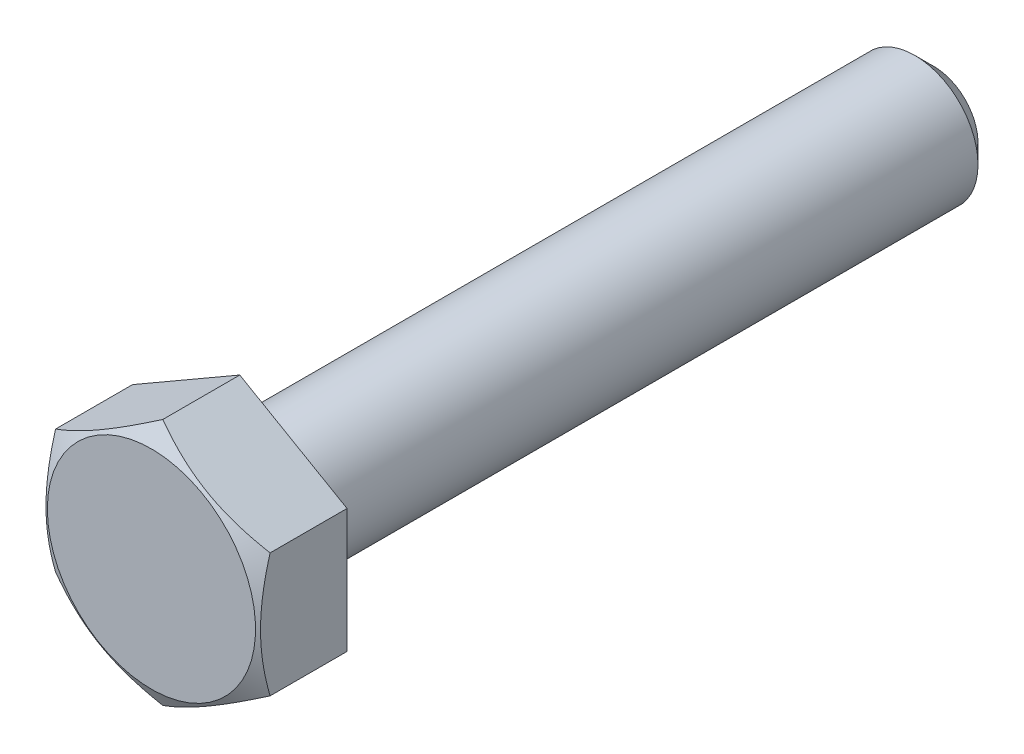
ISO-10303-21;
HEADER;
FILE_DESCRIPTION(('STEP AP214'),'2;1');
FILE_NAME('part.step','',(''),(''),'','','');
FILE_SCHEMA(('AUTOMOTIVE_DESIGN { 1 0 10303 214 1 1 1 1 }'));
ENDSEC;
DATA;
#1=APPLICATION_CONTEXT('core data for automotive mechanical design processes');
#2=APPLICATION_PROTOCOL_DEFINITION('international standard','automotive_design',2000,#1);
#3=PRODUCT_CONTEXT('',#1,'mechanical');
#4=PRODUCT('Part','Part','',(#3));
#5=PRODUCT_RELATED_PRODUCT_CATEGORY('part','',(#4));
#6=PRODUCT_DEFINITION_FORMATION('','',#4);
#7=PRODUCT_DEFINITION_CONTEXT('part definition',#1,'design');
#8=PRODUCT_DEFINITION('design','',#6,#7);
#9=PRODUCT_DEFINITION_SHAPE('','',#8);
#10=(LENGTH_UNIT() NAMED_UNIT(*) SI_UNIT(.MILLI.,.METRE.));
#11=(NAMED_UNIT(*) PLANE_ANGLE_UNIT() SI_UNIT($,.RADIAN.));
#12=(NAMED_UNIT(*) SI_UNIT($,.STERADIAN.) SOLID_ANGLE_UNIT());
#13=UNCERTAINTY_MEASURE_WITH_UNIT(LENGTH_MEASURE(1.E-05),#10,'distance_accuracy_value','');
#14=(GEOMETRIC_REPRESENTATION_CONTEXT(3) GLOBAL_UNCERTAINTY_ASSIGNED_CONTEXT((#13)) GLOBAL_UNIT_ASSIGNED_CONTEXT((#10,
#11,#12)) REPRESENTATION_CONTEXT('',''));
#15=CARTESIAN_POINT('',(0.,0.,0.));
#16=DIRECTION('',(0.,0.,1.));
#17=DIRECTION('',(1.,0.,0.));
#18=AXIS2_PLACEMENT_3D('',#15,#16,#17);
#19=CARTESIAN_POINT('',(0.,9.81495457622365,0.));
#20=DIRECTION('',(0.,0.,1.));
#21=DIRECTION('',(1.,0.,0.));
#22=AXIS2_PLACEMENT_3D('',#19,#20,#21);
#23=PLANE('',#22);
#24=DIRECTION('',(-0.866025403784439,0.5,0.));
#25=VECTOR('',#24,1.);
#26=CARTESIAN_POINT('',(8.5,4.90747728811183,0.));
#27=LINE('',#26,#25);
#28=CARTESIAN_POINT('',(8.5,4.90747728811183,0.));
#29=VERTEX_POINT('',#28);
#30=CARTESIAN_POINT('',(0.,9.81495457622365,0.));
#31=VERTEX_POINT('',#30);
#32=EDGE_CURVE('E77',#29,#31,#27,.T.);
#33=ORIENTED_EDGE('',*,*,#32,.F.);
#34=DIRECTION('',(0.,1.,0.));
#35=VECTOR('',#34,1.);
#36=CARTESIAN_POINT('',(8.5,-4.90747728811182,0.));
#37=LINE('',#36,#35);
#38=CARTESIAN_POINT('',(8.5,-4.90747728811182,0.));
#39=VERTEX_POINT('',#38);
#40=EDGE_CURVE('E82',#39,#29,#37,.T.);
#41=ORIENTED_EDGE('',*,*,#40,.F.);
#42=DIRECTION('',(0.866025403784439,0.5,0.));
#43=VECTOR('',#42,1.);
#44=CARTESIAN_POINT('',(0.,-9.81495457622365,0.));
#45=LINE('',#44,#43);
#46=CARTESIAN_POINT('',(0.,-9.81495457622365,0.));
#47=VERTEX_POINT('',#46);
#48=EDGE_CURVE('E88',#47,#39,#45,.T.);
#49=ORIENTED_EDGE('',*,*,#48,.F.);
#50=DIRECTION('',(0.866025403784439,-0.5,0.));
#51=VECTOR('',#50,1.);
#52=CARTESIAN_POINT('',(-8.5,-4.90747728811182,0.));
#53=LINE('',#52,#51);
#54=CARTESIAN_POINT('',(-8.5,-4.90747728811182,0.));
#55=VERTEX_POINT('',#54);
#56=EDGE_CURVE('E199',#55,#47,#53,.T.);
#57=ORIENTED_EDGE('',*,*,#56,.F.);
#58=DIRECTION('',(0.,-1.,0.));
#59=VECTOR('',#58,1.);
#60=CARTESIAN_POINT('',(-8.5,4.90747728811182,0.));
#61=LINE('',#60,#59);
#62=CARTESIAN_POINT('',(-8.5,4.90747728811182,0.));
#63=VERTEX_POINT('',#62);
#64=EDGE_CURVE('E209',#63,#55,#61,.T.);
#65=ORIENTED_EDGE('',*,*,#64,.F.);
#66=DIRECTION('',(-0.866025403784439,-0.5,0.));
#67=VECTOR('',#66,1.);
#68=CARTESIAN_POINT('',(0.,9.81495457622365,0.));
#69=LINE('',#68,#67);
#70=EDGE_CURVE('E207',#31,#63,#69,.T.);
#71=ORIENTED_EDGE('',*,*,#70,.F.);
#72=EDGE_LOOP('',(#33,#41,#49,#57,#65,#71));
#73=FACE_BOUND('',#72,.T.);
#74=CARTESIAN_POINT('',(0.,0.,0.));
#75=DIRECTION('',(0.,0.,1.));
#76=DIRECTION('',(1.,0.,0.));
#77=AXIS2_PLACEMENT_3D('',#74,#75,#76);
#78=CIRCLE('',#77,5.);
#79=CARTESIAN_POINT('',(5.,0.,0.));
#80=VERTEX_POINT('',#79);
#81=EDGE_CURVE('E98',#80,#80,#78,.F.);
#82=ORIENTED_EDGE('',*,*,#81,.F.);
#83=EDGE_LOOP('',(#82));
#84=FACE_BOUND('',#83,.T.);
#85=ADVANCED_FACE('F14',(#73,#84),#23,.F.);
#86=CARTESIAN_POINT('',(8.5,4.90747728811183,7.));
#87=DIRECTION('',(-0.5,-0.866025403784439,0.));
#88=DIRECTION('',(0.866025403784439,-0.5,0.));
#89=AXIS2_PLACEMENT_3D('',#86,#87,#88);
#90=PLANE('',#89);
#91=DIRECTION('',(0.,0.,-1.));
#92=VECTOR('',#91,1.);
#93=CARTESIAN_POINT('',(0.,9.81495457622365,7.));
#94=LINE('',#93,#92);
#95=CARTESIAN_POINT('',(0.,9.81495457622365,6.09647305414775));
#96=VERTEX_POINT('',#95);
#97=EDGE_CURVE('E76',#96,#31,#94,.T.);
#98=ORIENTED_EDGE('',*,*,#97,.F.);
#99=CARTESIAN_POINT('',(-0.00019999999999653,9.81507004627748,6.09640638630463));
#100=CARTESIAN_POINT('',(0.186639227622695,9.70719836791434,6.15867629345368));
#101=CARTESIAN_POINT('',(0.374175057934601,9.59892450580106,6.21812013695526));
#102=CARTESIAN_POINT('',(0.750769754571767,9.38149745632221,6.33057732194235));
#103=CARTESIAN_POINT('',(0.939829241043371,9.27234391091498,6.38358788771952));
#104=CARTESIAN_POINT('',(1.5100347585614,8.94313560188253,6.53192904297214));
#105=CARTESIAN_POINT('',(1.89343164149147,8.72178130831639,6.61630350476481));
#106=CARTESIAN_POINT('',(2.46717766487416,8.39052888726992,6.71524241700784));
#107=CARTESIAN_POINT('',(2.65581276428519,8.28162036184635,6.7434272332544));
#108=CARTESIAN_POINT('',(3.03393602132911,8.06331079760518,6.79068834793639));
#109=CARTESIAN_POINT('',(3.22342410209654,7.95390980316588,6.80976545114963));
#110=CARTESIAN_POINT('',(3.6027265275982,7.73491944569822,6.83832766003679));
#111=CARTESIAN_POINT('',(3.79254025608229,7.62533043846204,6.84782365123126));
#112=CARTESIAN_POINT('',(4.17234305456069,7.40605119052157,6.85702005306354));
#113=CARTESIAN_POINT('',(4.36233211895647,7.29636095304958,6.85672076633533));
#114=CARTESIAN_POINT('',(4.71752301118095,7.09129139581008,6.84700795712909));
#115=CARTESIAN_POINT('',(4.8827499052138,6.99589760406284,6.83877926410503));
#116=CARTESIAN_POINT('',(5.21281671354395,6.80533344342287,6.81507319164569));
#117=CARTESIAN_POINT('',(5.37765660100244,6.71016309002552,6.79959532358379));
#118=CARTESIAN_POINT('',(5.87153810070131,6.4250204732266,6.74265381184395));
#119=CARTESIAN_POINT('',(6.19970550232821,6.23555293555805,6.69068937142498));
#120=CARTESIAN_POINT('',(6.85952142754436,5.85460803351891,6.56077749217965));
#121=CARTESIAN_POINT('',(7.19108574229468,5.66317928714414,6.48227936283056));
#122=CARTESIAN_POINT('',(7.84926989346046,5.28317649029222,6.30412109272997));
#123=CARTESIAN_POINT('',(8.17589815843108,5.0945975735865,6.20450279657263));
#124=CARTESIAN_POINT('',(8.5002,4.90736181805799,6.09640638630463));
#125=B_SPLINE_CURVE_WITH_KNOTS('',3,(#99,#100,#101,#102,#103,#104,#105,#106,#107,#108,#109,#110,
#111,#112,#113,#114,#115,#116,#117,#118,#119,#120,#121,#122,#123,#124),.UNSPECIFIED.,.F.,.F.,(4,
2,2,2,2,2,2,2,2,2,2,2,4),(0.,0.673596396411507,1.34748239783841,2.69805431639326,
3.35679995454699,4.01548737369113,4.67342558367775,5.33134346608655,5.90409556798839,
6.47688628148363,7.62328361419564,8.79510569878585,9.96462743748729),.UNSPECIFIED.);
#126=CARTESIAN_POINT('',(8.5,4.90747728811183,6.09647305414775));
#127=VERTEX_POINT('',#126);
#128=EDGE_CURVE('E68',#96,#127,#125,.T.);
#129=ORIENTED_EDGE('',*,*,#128,.T.);
#130=DIRECTION('',(0.,0.,-1.));
#131=VECTOR('',#130,1.);
#132=CARTESIAN_POINT('',(8.5,4.90747728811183,7.));
#133=LINE('',#132,#131);
#134=EDGE_CURVE('E37',#127,#29,#133,.T.);
#135=ORIENTED_EDGE('',*,*,#134,.T.);
#136=ORIENTED_EDGE('',*,*,#32,.T.);
#137=EDGE_LOOP('',(#98,#129,#135,#136));
#138=FACE_BOUND('',#137,.T.);
#139=ADVANCED_FACE('F75',(#138),#90,.F.);
#140=CARTESIAN_POINT('',(0.,9.81495457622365,7.));
#141=DIRECTION('',(0.5,-0.866025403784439,0.));
#142=DIRECTION('',(0.866025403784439,0.5,0.));
#143=AXIS2_PLACEMENT_3D('',#140,#141,#142);
#144=PLANE('',#143);
#145=DIRECTION('',(0.,0.,-1.));
#146=VECTOR('',#145,1.);
#147=CARTESIAN_POINT('',(-8.5,4.90747728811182,7.));
#148=LINE('',#147,#146);
#149=CARTESIAN_POINT('',(-8.5,4.90747728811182,6.09647305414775));
#150=VERTEX_POINT('',#149);
#151=EDGE_CURVE('E95',#150,#63,#148,.T.);
#152=ORIENTED_EDGE('',*,*,#151,.F.);
#153=CARTESIAN_POINT('',(-8.5002,4.90736181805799,6.09640638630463));
#154=CARTESIAN_POINT('',(-8.31336077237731,5.01523349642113,6.15867629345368));
#155=CARTESIAN_POINT('',(-8.1258249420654,5.12350735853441,6.21812013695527));
#156=CARTESIAN_POINT('',(-7.74923024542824,5.34093440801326,6.33057732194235));
#157=CARTESIAN_POINT('',(-7.56017075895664,5.4500879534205,6.38358788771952));
#158=CARTESIAN_POINT('',(-6.98996524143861,5.77929626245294,6.53192904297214));
#159=CARTESIAN_POINT('',(-6.60656835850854,6.00065055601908,6.61630350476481));
#160=CARTESIAN_POINT('',(-6.03282233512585,6.33190297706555,6.71524241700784));
#161=CARTESIAN_POINT('',(-5.84418723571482,6.44081150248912,6.7434272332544));
#162=CARTESIAN_POINT('',(-5.4660639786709,6.65912106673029,6.79068834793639));
#163=CARTESIAN_POINT('',(-5.27657589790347,6.76852206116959,6.80976545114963));
#164=CARTESIAN_POINT('',(-4.89727347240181,6.98751241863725,6.83832766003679));
#165=CARTESIAN_POINT('',(-4.70745974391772,7.09710142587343,6.84782365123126));
#166=CARTESIAN_POINT('',(-4.32765694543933,7.3163806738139,6.85702005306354));
#167=CARTESIAN_POINT('',(-4.13766788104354,7.42607091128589,6.85672076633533));
#168=CARTESIAN_POINT('',(-3.78247698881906,7.63114046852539,6.84700795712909));
#169=CARTESIAN_POINT('',(-3.61725009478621,7.72653426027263,6.83877926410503));
#170=CARTESIAN_POINT('',(-3.28718328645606,7.9170984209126,6.81507319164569));
#171=CARTESIAN_POINT('',(-3.12234339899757,8.01226877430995,6.79959532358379));
#172=CARTESIAN_POINT('',(-2.6284618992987,8.29741139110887,6.74265381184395));
#173=CARTESIAN_POINT('',(-2.3002944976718,8.48687892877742,6.69068937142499));
#174=CARTESIAN_POINT('',(-1.64047857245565,8.86782383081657,6.56077749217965));
#175=CARTESIAN_POINT('',(-1.30891425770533,9.05925257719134,6.48227936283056));
#176=CARTESIAN_POINT('',(-0.650730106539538,9.43925537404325,6.30412109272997));
#177=CARTESIAN_POINT('',(-0.32410184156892,9.62783429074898,6.20450279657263));
#178=CARTESIAN_POINT('',(0.000200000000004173,9.81507004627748,6.09640638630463));
#179=B_SPLINE_CURVE_WITH_KNOTS('',3,(#153,#154,#155,#156,#157,#158,#159,#160,#161,#162,#163,
#164,#165,#166,#167,#168,#169,#170,#171,#172,#173,#174,#175,#176,#177,#178),.UNSPECIFIED.,.F.,
.F.,(4,2,2,2,2,2,2,2,2,2,2,2,4),(0.,0.673596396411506,1.34748239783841,2.69805431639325,
3.35679995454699,4.01548737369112,4.67342558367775,5.33134346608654,5.90409556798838,
6.47688628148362,7.62328361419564,8.79510569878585,9.9646274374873),.UNSPECIFIED.);
#180=EDGE_CURVE('E78',#150,#96,#179,.T.);
#181=ORIENTED_EDGE('',*,*,#180,.T.);
#182=ORIENTED_EDGE('',*,*,#97,.T.);
#183=ORIENTED_EDGE('',*,*,#70,.T.);
#184=EDGE_LOOP('',(#152,#181,#182,#183));
#185=FACE_BOUND('',#184,.T.);
#186=ADVANCED_FACE('F122',(#185),#144,.F.);
#187=CARTESIAN_POINT('',(-8.5,4.90747728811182,7.));
#188=DIRECTION('',(1.,0.,0.));
#189=DIRECTION('',(0.,1.,0.));
#190=AXIS2_PLACEMENT_3D('',#187,#188,#189);
#191=PLANE('',#190);
#192=DIRECTION('',(0.,0.,-1.));
#193=VECTOR('',#192,1.);
#194=CARTESIAN_POINT('',(-8.5,-4.90747728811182,7.));
#195=LINE('',#194,#193);
#196=CARTESIAN_POINT('',(-8.5,-4.90747728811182,6.09647305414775));
#197=VERTEX_POINT('',#196);
#198=EDGE_CURVE('E93',#197,#55,#195,.T.);
#199=ORIENTED_EDGE('',*,*,#198,.F.);
#200=CARTESIAN_POINT('',(-8.5,-13.1026642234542,2.74593746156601));
#201=CARTESIAN_POINT('',(-8.5,-12.7320710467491,2.92538754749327));
#202=CARTESIAN_POINT('',(-8.50000000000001,-12.3606185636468,3.1030938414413));
#203=CARTESIAN_POINT('',(-8.50000000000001,-11.6155376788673,3.45403645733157));
#204=CARTESIAN_POINT('',(-8.50000000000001,-11.2419089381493,3.62727205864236));
#205=CARTESIAN_POINT('',(-8.50000000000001,-10.4900547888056,3.96917951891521));
#206=CARTESIAN_POINT('',(-8.50000000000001,-10.1118153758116,4.13782069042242));
#207=CARTESIAN_POINT('',(-8.50000000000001,-9.35230025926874,4.46809461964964));
#208=CARTESIAN_POINT('',(-8.50000000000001,-8.97102470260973,4.62972771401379));
#209=CARTESIAN_POINT('',(-8.50000000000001,-8.19283605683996,4.94905443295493));
#210=CARTESIAN_POINT('',(-8.50000000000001,-7.79580686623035,5.10646670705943));
#211=CARTESIAN_POINT('',(-8.50000000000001,-6.99707523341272,5.4091842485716));
#212=CARTESIAN_POINT('',(-8.5,-6.59537226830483,5.55448814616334));
#213=CARTESIAN_POINT('',(-8.5,-5.7874270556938,5.82911560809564));
#214=CARTESIAN_POINT('',(-8.50000000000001,-5.38119616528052,5.95847222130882));
#215=CARTESIAN_POINT('',(-8.5,-4.5629229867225,6.1970038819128));
#216=CARTESIAN_POINT('',(-8.5,-4.15088259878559,6.30618537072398));
#217=CARTESIAN_POINT('',(-8.5,-3.32295792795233,6.49849151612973));
#218=CARTESIAN_POINT('',(-8.5,-2.90710664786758,6.58175438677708));
#219=CARTESIAN_POINT('',(-8.5,-2.27960724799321,6.68356538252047));
#220=CARTESIAN_POINT('',(-8.5,-2.06980434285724,6.71365656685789));
#221=CARTESIAN_POINT('',(-8.5,-1.64918293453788,6.76555254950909));
#222=CARTESIAN_POINT('',(-8.5,-1.43836453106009,6.78735814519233));
#223=CARTESIAN_POINT('',(-8.5,-1.01871348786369,6.82197913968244));
#224=CARTESIAN_POINT('',(-8.5,-0.809890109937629,6.83490638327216));
#225=CARTESIAN_POINT('',(-8.5,-0.39188410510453,6.85192420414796));
#226=CARTESIAN_POINT('',(-8.5,-0.182701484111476,6.85601492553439));
#227=CARTESIAN_POINT('',(-8.5,0.235650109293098,6.85526233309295));
#228=CARTESIAN_POINT('',(-8.5,0.444819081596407,6.85041895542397));
#229=CARTESIAN_POINT('',(-8.5,0.86276947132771,6.83191500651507));
#230=CARTESIAN_POINT('',(-8.5,1.07155086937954,6.81825400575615));
#231=CARTESIAN_POINT('',(-8.5,1.57574896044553,6.77490263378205));
#232=CARTESIAN_POINT('',(-8.5,1.87080068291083,6.74089371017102));
#233=CARTESIAN_POINT('',(-8.5,2.45866338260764,6.65713713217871));
#234=CARTESIAN_POINT('',(-8.5,2.75147403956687,6.60738726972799));
#235=CARTESIAN_POINT('',(-8.5,3.33459303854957,6.49391875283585));
#236=CARTESIAN_POINT('',(-8.5,3.62489919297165,6.43018896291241));
#237=CARTESIAN_POINT('',(-8.5,4.20257464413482,6.29070067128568));
#238=CARTESIAN_POINT('',(-8.5,4.48994399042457,6.21494237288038));
#239=CARTESIAN_POINT('',(-8.5,5.0680151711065,6.05145913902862));
#240=CARTESIAN_POINT('',(-8.5,5.35865292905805,5.96350918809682));
#241=CARTESIAN_POINT('',(-8.5,5.93706457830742,5.77869577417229));
#242=CARTESIAN_POINT('',(-8.5,6.22483845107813,5.68183225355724));
#243=CARTESIAN_POINT('',(-8.5,6.79766756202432,5.48071443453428));
#244=CARTESIAN_POINT('',(-8.5,7.08272370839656,5.3764627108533));
#245=CARTESIAN_POINT('',(-8.5,7.65048563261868,5.1617779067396));
#246=CARTESIAN_POINT('',(-8.5,7.93319143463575,5.05134488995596));
#247=CARTESIAN_POINT('',(-8.5,8.58625691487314,4.78932204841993));
#248=CARTESIAN_POINT('',(-8.5,8.95585125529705,4.63582786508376));
#249=CARTESIAN_POINT('',(-8.5,9.69201525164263,4.32173022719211));
#250=CARTESIAN_POINT('',(-8.5,10.0585847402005,4.16112638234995));
#251=CARTESIAN_POINT('',(-8.5,10.7892442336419,3.83419501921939));
#252=CARTESIAN_POINT('',(-8.5,11.1533337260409,3.66786635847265));
#253=CARTESIAN_POINT('',(-8.5,11.879361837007,3.33060757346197));
#254=CARTESIAN_POINT('',(-8.5,12.2413004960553,3.15967753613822));
#255=CARTESIAN_POINT('',(-8.5,12.9637389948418,2.81388116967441));
#256=CARTESIAN_POINT('',(-8.5,13.3242370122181,2.63901103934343));
#257=CARTESIAN_POINT('',(-8.5,14.0437060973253,2.28615454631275));
#258=CARTESIAN_POINT('',(-8.5,14.4026771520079,2.10816815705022));
#259=CARTESIAN_POINT('',(-8.5,15.4775690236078,1.57038636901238));
#260=CARTESIAN_POINT('',(-8.5,16.1915560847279,1.20672611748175));
#261=CARTESIAN_POINT('',(-8.5,17.5583767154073,0.501692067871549));
#262=CARTESIAN_POINT('',(-8.49999999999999,18.2115029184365,0.160883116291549));
#263=CARTESIAN_POINT('',(-8.49999999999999,19.515315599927,-0.525416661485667));
#264=CARTESIAN_POINT('',(-8.49999999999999,20.1660019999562,-0.870907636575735));
#265=CARTESIAN_POINT('',(-8.49999999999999,21.4639477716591,-1.56466133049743));
#266=CARTESIAN_POINT('',(-8.49999999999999,22.1112115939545,-1.91291573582));
#267=CARTESIAN_POINT('',(-8.49999999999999,23.4041708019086,-2.6122458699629));
#268=CARTESIAN_POINT('',(-8.49999999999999,24.0498662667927,-2.96332145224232));
#269=CARTESIAN_POINT('',(-8.5,24.69498034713,-3.3154549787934));
#270=B_SPLINE_CURVE_WITH_KNOTS('',3,(#200,#201,#202,#203,#204,#205,#206,#207,#208,#209,#210,
#211,#212,#213,#214,#215,#216,#217,#218,#219,#220,#221,#222,#223,#224,#225,#226,#227,#228,#229,
#230,#231,#232,#233,#234,#235,#236,#237,#238,#239,#240,#241,#242,#243,#244,#245,#246,#247,#248,
#249,#250,#251,#252,#253,#254,#255,#256,#257,#258,#259,#260,#261,#262,#263,#264,#265,#266,#267,
#268,#269),.UNSPECIFIED.,.F.,.F.,(4,2,2,2,2,2,2,2,2,2,2,2,2,2,2,2,2,2,2,2,2,2,2,2,2,2,2,2,2,2,2,
2,2,2,4),(0.,1.23527849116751,2.47075486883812,3.71309244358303,4.95537027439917,
6.23650441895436,7.51778330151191,8.79636058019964,10.0745289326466,11.3457596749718,
11.9814713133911,12.6171217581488,13.2446100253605,13.8720880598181,14.4995705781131,
15.1270836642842,16.017604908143,16.9082511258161,17.7996093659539,18.690952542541,
19.6017420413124,20.5125374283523,21.4230169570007,22.3334871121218,23.5339891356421,
24.7345571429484,25.9353661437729,27.1361524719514,28.3381515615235,29.5401609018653,
31.9438880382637,34.1539630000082,36.3641084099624,38.569114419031,40.774006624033),.UNSPECIFIED.);
#271=EDGE_CURVE('E160',#197,#150,#270,.T.);
#272=ORIENTED_EDGE('',*,*,#271,.T.);
#273=ORIENTED_EDGE('',*,*,#151,.T.);
#274=ORIENTED_EDGE('',*,*,#64,.T.);
#275=EDGE_LOOP('',(#199,#272,#273,#274));
#276=FACE_BOUND('',#275,.T.);
#277=ADVANCED_FACE('F179',(#276),#191,.F.);
#278=CARTESIAN_POINT('',(-8.5,-4.90747728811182,7.));
#279=DIRECTION('',(0.5,0.866025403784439,0.));
#280=DIRECTION('',(-0.866025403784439,0.5,0.));
#281=AXIS2_PLACEMENT_3D('',#278,#279,#280);
#282=PLANE('',#281);
#283=DIRECTION('',(0.,0.,-1.));
#284=VECTOR('',#283,1.);
#285=CARTESIAN_POINT('',(0.,-9.81495457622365,7.));
#286=LINE('',#285,#284);
#287=CARTESIAN_POINT('',(0.,-9.81495457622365,6.09647305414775));
#288=VERTEX_POINT('',#287);
#289=EDGE_CURVE('E86',#288,#47,#286,.T.);
#290=ORIENTED_EDGE('',*,*,#289,.F.);
#291=CARTESIAN_POINT('',(0.000199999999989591,-9.81507004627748,6.09640638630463));
#292=CARTESIAN_POINT('',(-0.186639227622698,-9.70719836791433,6.15867629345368));
#293=CARTESIAN_POINT('',(-0.374175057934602,-9.59892450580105,6.21812013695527));
#294=CARTESIAN_POINT('',(-0.750769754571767,-9.3814974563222,6.33057732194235));
#295=CARTESIAN_POINT('',(-0.939829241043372,-9.27234391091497,6.38358788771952));
#296=CARTESIAN_POINT('',(-1.5100347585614,-8.94313560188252,6.53192904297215));
#297=CARTESIAN_POINT('',(-1.89343164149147,-8.72178130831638,6.61630350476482));
#298=CARTESIAN_POINT('',(-2.46717766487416,-8.39052888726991,6.71524241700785));
#299=CARTESIAN_POINT('',(-2.65581276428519,-8.28162036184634,6.7434272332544));
#300=CARTESIAN_POINT('',(-3.03393602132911,-8.06331079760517,6.7906883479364));
#301=CARTESIAN_POINT('',(-3.22342410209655,-7.95390980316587,6.80976545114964));
#302=CARTESIAN_POINT('',(-3.6027265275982,-7.73491944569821,6.8383276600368));
#303=CARTESIAN_POINT('',(-3.79254025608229,-7.62533043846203,6.84782365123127));
#304=CARTESIAN_POINT('',(-4.17234305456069,-7.40605119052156,6.85702005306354));
#305=CARTESIAN_POINT('',(-4.36233211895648,-7.29636095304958,6.85672076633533));
#306=CARTESIAN_POINT('',(-4.71752301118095,-7.09129139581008,6.84700795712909));
#307=CARTESIAN_POINT('',(-4.8827499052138,-6.99589760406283,6.83877926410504));
#308=CARTESIAN_POINT('',(-5.21281671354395,-6.80533344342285,6.81507319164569));
#309=CARTESIAN_POINT('',(-5.37765660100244,-6.71016309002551,6.79959532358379));
#310=CARTESIAN_POINT('',(-5.87153810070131,-6.42502047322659,6.74265381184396));
#311=CARTESIAN_POINT('',(-6.19970550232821,-6.23555293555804,6.69068937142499));
#312=CARTESIAN_POINT('',(-6.85952142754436,-5.8546080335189,6.56077749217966));
#313=CARTESIAN_POINT('',(-7.19108574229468,-5.66317928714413,6.48227936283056));
#314=CARTESIAN_POINT('',(-7.84926989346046,-5.28317649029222,6.30412109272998));
#315=CARTESIAN_POINT('',(-8.17589815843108,-5.09459757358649,6.20450279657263));
#316=CARTESIAN_POINT('',(-8.5002,-4.90736181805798,6.09640638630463));
#317=B_SPLINE_CURVE_WITH_KNOTS('',3,(#291,#292,#293,#294,#295,#296,#297,#298,#299,#300,#301,
#302,#303,#304,#305,#306,#307,#308,#309,#310,#311,#312,#313,#314,#315,#316),.UNSPECIFIED.,.F.,
.F.,(4,2,2,2,2,2,2,2,2,2,2,2,4),(0.,0.673596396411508,1.34748239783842,2.69805431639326,
3.35679995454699,4.01548737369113,4.67342558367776,5.33134346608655,5.90409556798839,
6.47688628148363,7.62328361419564,8.79510569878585,9.96462743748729),.UNSPECIFIED.);
#318=EDGE_CURVE('E154',#288,#197,#317,.T.);
#319=ORIENTED_EDGE('',*,*,#318,.T.);
#320=ORIENTED_EDGE('',*,*,#198,.T.);
#321=ORIENTED_EDGE('',*,*,#56,.T.);
#322=EDGE_LOOP('',(#290,#319,#320,#321));
#323=FACE_BOUND('',#322,.T.);
#324=ADVANCED_FACE('F184',(#323),#282,.F.);
#325=CARTESIAN_POINT('',(0.,-9.81495457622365,7.));
#326=DIRECTION('',(-0.5,0.866025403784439,0.));
#327=DIRECTION('',(-0.866025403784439,-0.5,0.));
#328=AXIS2_PLACEMENT_3D('',#325,#326,#327);
#329=PLANE('',#328);
#330=DIRECTION('',(0.,0.,-1.));
#331=VECTOR('',#330,1.);
#332=CARTESIAN_POINT('',(8.5,-4.90747728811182,7.));
#333=LINE('',#332,#331);
#334=CARTESIAN_POINT('',(8.5,-4.90747728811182,6.09647305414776));
#335=VERTEX_POINT('',#334);
#336=EDGE_CURVE('E84',#335,#39,#333,.T.);
#337=ORIENTED_EDGE('',*,*,#336,.F.);
#338=CARTESIAN_POINT('',(8.5002,-4.90736181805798,6.09640638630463));
#339=CARTESIAN_POINT('',(8.31336077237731,-5.01523349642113,6.15867629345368));
#340=CARTESIAN_POINT('',(8.12582494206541,-5.12350735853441,6.21812013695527));
#341=CARTESIAN_POINT('',(7.74923024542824,-5.34093440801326,6.33057732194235));
#342=CARTESIAN_POINT('',(7.56017075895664,-5.45008795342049,6.38358788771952));
#343=CARTESIAN_POINT('',(6.98996524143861,-5.77929626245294,6.53192904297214));
#344=CARTESIAN_POINT('',(6.60656835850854,-6.00065055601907,6.61630350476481));
#345=CARTESIAN_POINT('',(6.03282233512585,-6.33190297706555,6.71524241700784));
#346=CARTESIAN_POINT('',(5.84418723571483,-6.44081150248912,6.7434272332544));
#347=CARTESIAN_POINT('',(5.4660639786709,-6.65912106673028,6.7906883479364));
#348=CARTESIAN_POINT('',(5.27657589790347,-6.76852206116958,6.80976545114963));
#349=CARTESIAN_POINT('',(4.89727347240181,-6.98751241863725,6.83832766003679));
#350=CARTESIAN_POINT('',(4.70745974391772,-7.09710142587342,6.84782365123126));
#351=CARTESIAN_POINT('',(4.32765694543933,-7.31638067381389,6.85702005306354));
#352=CARTESIAN_POINT('',(4.13766788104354,-7.42607091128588,6.85672076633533));
#353=CARTESIAN_POINT('',(3.78247698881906,-7.63114046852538,6.84700795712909));
#354=CARTESIAN_POINT('',(3.61725009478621,-7.72653426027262,6.83877926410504));
#355=CARTESIAN_POINT('',(3.28718328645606,-7.9170984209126,6.81507319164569));
#356=CARTESIAN_POINT('',(3.12234339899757,-8.01226877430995,6.79959532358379));
#357=CARTESIAN_POINT('',(2.6284618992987,-8.29741139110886,6.74265381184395));
#358=CARTESIAN_POINT('',(2.30029449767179,-8.48687892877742,6.69068937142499));
#359=CARTESIAN_POINT('',(1.64047857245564,-8.86782383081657,6.56077749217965));
#360=CARTESIAN_POINT('',(1.30891425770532,-9.05925257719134,6.48227936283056));
#361=CARTESIAN_POINT('',(0.650730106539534,-9.43925537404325,6.30412109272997));
#362=CARTESIAN_POINT('',(0.324101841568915,-9.62783429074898,6.20450279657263));
#363=CARTESIAN_POINT('',(-0.000200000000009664,-9.81507004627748,6.09640638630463));
#364=B_SPLINE_CURVE_WITH_KNOTS('',3,(#338,#339,#340,#341,#342,#343,#344,#345,#346,#347,#348,
#349,#350,#351,#352,#353,#354,#355,#356,#357,#358,#359,#360,#361,#362,#363),.UNSPECIFIED.,.F.,
.F.,(4,2,2,2,2,2,2,2,2,2,2,2,4),(0.,0.673596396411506,1.34748239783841,2.69805431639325,
3.35679995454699,4.01548737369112,4.67342558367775,5.33134346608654,5.90409556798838,
6.47688628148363,7.62328361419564,8.79510569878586,9.96462743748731),.UNSPECIFIED.);
#365=EDGE_CURVE('E29',#335,#288,#364,.T.);
#366=ORIENTED_EDGE('',*,*,#365,.T.);
#367=ORIENTED_EDGE('',*,*,#289,.T.);
#368=ORIENTED_EDGE('',*,*,#48,.T.);
#369=EDGE_LOOP('',(#337,#366,#367,#368));
#370=FACE_BOUND('',#369,.T.);
#371=ADVANCED_FACE('F131',(#370),#329,.F.);
#372=CARTESIAN_POINT('',(8.5,-4.90747728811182,7.));
#373=DIRECTION('',(-1.,0.,0.));
#374=DIRECTION('',(0.,0.,1.));
#375=AXIS2_PLACEMENT_3D('',#372,#373,#374);
#376=PLANE('',#375);
#377=ORIENTED_EDGE('',*,*,#134,.F.);
#378=CARTESIAN_POINT('',(8.5,-13.1026642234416,2.74593746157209));
#379=CARTESIAN_POINT('',(8.5,-12.732071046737,2.9253875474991));
#380=CARTESIAN_POINT('',(8.5,-12.3606185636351,3.10309384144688));
#381=CARTESIAN_POINT('',(8.5,-11.6155376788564,3.45403645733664));
#382=CARTESIAN_POINT('',(8.5,-11.2419089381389,3.62727205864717));
#383=CARTESIAN_POINT('',(8.5,-10.490054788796,3.96917951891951));
#384=CARTESIAN_POINT('',(8.5,-10.1118153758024,4.13782069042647));
#385=CARTESIAN_POINT('',(8.5,-9.35230025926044,4.46809461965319));
#386=CARTESIAN_POINT('',(8.5,-8.97102470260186,4.62972771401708));
#387=CARTESIAN_POINT('',(8.5,-8.19283605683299,4.94905443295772));
#388=CARTESIAN_POINT('',(8.5,-7.79580686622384,5.10646670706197));
#389=CARTESIAN_POINT('',(8.5,-6.99707523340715,5.40918424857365));
#390=CARTESIAN_POINT('',(8.5,-6.59537226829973,5.55448814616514));
#391=CARTESIAN_POINT('',(8.5,-5.78742705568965,5.82911560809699));
#392=CARTESIAN_POINT('',(8.5,-5.38119616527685,5.95847222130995));
#393=CARTESIAN_POINT('',(8.5,-4.56292298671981,6.19700388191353));
#394=CARTESIAN_POINT('',(8.5,-4.1508825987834,6.30618537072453));
#395=CARTESIAN_POINT('',(8.5,-3.32295792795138,6.49849151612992));
#396=CARTESIAN_POINT('',(8.5,-2.90710664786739,6.5817543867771));
#397=CARTESIAN_POINT('',(8.5,-2.27960724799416,6.68356538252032));
#398=CARTESIAN_POINT('',(8.5,-2.06980434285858,6.7136565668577));
#399=CARTESIAN_POINT('',(8.5,-1.64918293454,6.76555254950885));
#400=CARTESIAN_POINT('',(8.5,-1.43836453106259,6.78735814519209));
#401=CARTESIAN_POINT('',(8.5,-1.01871348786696,6.82197913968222));
#402=CARTESIAN_POINT('',(8.5,-0.809890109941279,6.83490638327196));
#403=CARTESIAN_POINT('',(8.5,-0.391884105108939,6.85192420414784));
#404=CARTESIAN_POINT('',(8.5,-0.182701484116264,6.85601492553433));
#405=CARTESIAN_POINT('',(8.5,0.235650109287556,6.85526233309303));
#406=CARTESIAN_POINT('',(8.5,0.444819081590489,6.85041895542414));
#407=CARTESIAN_POINT('',(8.5,0.862769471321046,6.83191500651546));
#408=CARTESIAN_POINT('',(8.5,1.0715508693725,6.81825400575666));
#409=CARTESIAN_POINT('',(8.5,1.57574896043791,6.77490263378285));
#410=CARTESIAN_POINT('',(8.5,1.870800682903,6.74089371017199));
#411=CARTESIAN_POINT('',(8.5,2.45866338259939,6.65713713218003));
#412=CARTESIAN_POINT('',(8.5,2.75147403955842,6.60738726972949));
#413=CARTESIAN_POINT('',(8.5,3.33459303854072,6.49391875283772));
#414=CARTESIAN_POINT('',(8.5,3.6248991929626,6.43018896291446));
#415=CARTESIAN_POINT('',(8.5,4.20257464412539,6.2907006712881));
#416=CARTESIAN_POINT('',(8.5,4.48994399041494,6.21494237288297));
#417=CARTESIAN_POINT('',(8.5,5.06801517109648,6.05145913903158));
#418=CARTESIAN_POINT('',(8.5,5.35865292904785,5.96350918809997));
#419=CARTESIAN_POINT('',(8.5,5.93706457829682,5.7786957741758));
#420=CARTESIAN_POINT('',(8.5,6.22483845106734,5.68183225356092));
#421=CARTESIAN_POINT('',(8.5,6.79766756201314,5.48071443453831));
#422=CARTESIAN_POINT('',(8.5,7.08272370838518,5.3764627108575));
#423=CARTESIAN_POINT('',(8.5,7.65048563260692,5.16177790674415));
#424=CARTESIAN_POINT('',(8.5,7.93319143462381,5.05134488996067));
#425=CARTESIAN_POINT('',(8.5,8.58625691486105,4.7893220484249));
#426=CARTESIAN_POINT('',(8.5,8.95585125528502,4.63582786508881));
#427=CARTESIAN_POINT('',(8.5,9.6920152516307,4.3217302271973));
#428=CARTESIAN_POINT('',(8.5,10.0585847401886,4.16112638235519));
#429=CARTESIAN_POINT('',(8.5,10.7892442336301,3.83419501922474));
#430=CARTESIAN_POINT('',(8.5,11.1533337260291,3.66786635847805));
#431=CARTESIAN_POINT('',(8.5,11.8793618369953,3.33060757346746));
#432=CARTESIAN_POINT('',(8.5,12.2413004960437,3.15967753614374));
#433=CARTESIAN_POINT('',(8.5,12.9637389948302,2.81388116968));
#434=CARTESIAN_POINT('',(8.5,13.3242370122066,2.63901103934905));
#435=CARTESIAN_POINT('',(8.5,14.0437060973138,2.28615454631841));
#436=CARTESIAN_POINT('',(8.5,14.4026771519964,2.1081681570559));
#437=CARTESIAN_POINT('',(8.5,15.4775690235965,1.57038636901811));
#438=CARTESIAN_POINT('',(8.5,16.1915560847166,1.20672611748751));
#439=CARTESIAN_POINT('',(8.5,17.5583767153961,0.501692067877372));
#440=CARTESIAN_POINT('',(8.5,18.2115029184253,0.160883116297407));
#441=CARTESIAN_POINT('',(8.5,19.5153155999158,-0.525416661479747));
#442=CARTESIAN_POINT('',(8.5,20.166001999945,-0.870907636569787));
#443=CARTESIAN_POINT('',(8.5,21.4639477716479,-1.56466133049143));
#444=CARTESIAN_POINT('',(8.5,22.1112115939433,-1.91291573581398));
#445=CARTESIAN_POINT('',(8.5,23.4041708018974,-2.61224586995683));
#446=CARTESIAN_POINT('',(8.5,24.0498662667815,-2.96332145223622));
#447=CARTESIAN_POINT('',(8.5,24.6949803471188,-3.31545497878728));
#448=B_SPLINE_CURVE_WITH_KNOTS('',3,(#378,#379,#380,#381,#382,#383,#384,#385,#386,#387,#388,
#389,#390,#391,#392,#393,#394,#395,#396,#397,#398,#399,#400,#401,#402,#403,#404,#405,#406,#407,
#408,#409,#410,#411,#412,#413,#414,#415,#416,#417,#418,#419,#420,#421,#422,#423,#424,#425,#426,
#427,#428,#429,#430,#431,#432,#433,#434,#435,#436,#437,#438,#439,#440,#441,#442,#443,#444,#445,
#446,#447),.UNSPECIFIED.,.F.,.F.,(4,2,2,2,2,2,2,2,2,2,2,2,2,2,2,2,2,2,2,2,2,2,2,2,2,2,2,2,2,2,2,
2,2,2,4),(0.,1.23527849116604,2.47075486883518,3.7130924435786,4.95537027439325,
6.23650441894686,7.51778330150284,8.796360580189,10.0745289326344,11.3457596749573,
11.9814713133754,12.617121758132,13.2446100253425,13.872088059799,14.4995705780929,
15.1270836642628,16.0176049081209,16.9082511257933,17.7996093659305,18.6909525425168,
19.6017420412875,20.5125374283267,21.4230169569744,22.3334871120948,23.5339891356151,
24.7345571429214,25.9353661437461,27.1361524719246,28.3381515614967,29.5401609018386,
31.9438880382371,34.1539629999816,36.3641084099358,38.5691144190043,40.7740066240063),.UNSPECIFIED.);
#449=EDGE_CURVE('E66',#127,#335,#448,.F.);
#450=ORIENTED_EDGE('',*,*,#449,.T.);
#451=ORIENTED_EDGE('',*,*,#336,.T.);
#452=ORIENTED_EDGE('',*,*,#40,.T.);
#453=EDGE_LOOP('',(#377,#450,#451,#452));
#454=FACE_BOUND('',#453,.T.);
#455=ADVANCED_FACE('F80',(#454),#376,.F.);
#456=CARTESIAN_POINT('',(0.,0.,7.));
#457=DIRECTION('',(0.,0.,-1.));
#458=DIRECTION('',(-1.,0.,0.));
#459=AXIS2_PLACEMENT_3D('',#456,#457,#458);
#460=CONICAL_SURFACE('',#459,8.25,1.0471975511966);
#461=CARTESIAN_POINT('',(0.,0.,7.));
#462=DIRECTION('',(0.,0.,-1.));
#463=DIRECTION('',(-1.,0.,0.));
#464=AXIS2_PLACEMENT_3D('',#461,#462,#463);
#465=CIRCLE('',#464,8.25);
#466=CARTESIAN_POINT('',(-8.25,0.,7.));
#467=VERTEX_POINT('',#466);
#468=EDGE_CURVE('E72',#467,#467,#465,.T.);
#469=ORIENTED_EDGE('',*,*,#468,.T.);
#470=EDGE_LOOP('',(#469));
#471=FACE_BOUND('',#470,.T.);
#472=ORIENTED_EDGE('',*,*,#180,.F.);
#473=ORIENTED_EDGE('',*,*,#271,.F.);
#474=ORIENTED_EDGE('',*,*,#318,.F.);
#475=ORIENTED_EDGE('',*,*,#365,.F.);
#476=ORIENTED_EDGE('',*,*,#449,.F.);
#477=ORIENTED_EDGE('',*,*,#128,.F.);
#478=EDGE_LOOP('',(#472,#473,#474,#475,#476,#477));
#479=FACE_BOUND('',#478,.T.);
#480=ADVANCED_FACE('F67',(#471,#479),#460,.T.);
#481=CARTESIAN_POINT('',(0.,9.81495457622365,7.));
#482=DIRECTION('',(0.,0.,1.));
#483=DIRECTION('',(1.,0.,0.));
#484=AXIS2_PLACEMENT_3D('',#481,#482,#483);
#485=PLANE('',#484);
#486=ORIENTED_EDGE('',*,*,#468,.F.);
#487=EDGE_LOOP('',(#486));
#488=FACE_BOUND('',#487,.T.);
#489=ADVANCED_FACE('F126',(#488),#485,.T.);
#490=CARTESIAN_POINT('',(0.,0.,-55.));
#491=DIRECTION('',(0.,0.,1.));
#492=DIRECTION('',(1.,0.,0.));
#493=AXIS2_PLACEMENT_3D('',#490,#491,#492);
#494=CYLINDRICAL_SURFACE('',#493,5.);
#495=CARTESIAN_POINT('',(0.,0.,-53.5));
#496=DIRECTION('',(0.,0.,-1.));
#497=DIRECTION('',(-1.,0.,0.));
#498=AXIS2_PLACEMENT_3D('',#495,#496,#497);
#499=CIRCLE('',#498,5.);
#500=CARTESIAN_POINT('',(-5.,0.,-53.5));
#501=VERTEX_POINT('',#500);
#502=EDGE_CURVE('E9',#501,#501,#499,.F.);
#503=ORIENTED_EDGE('',*,*,#502,.T.);
#504=EDGE_LOOP('',(#503));
#505=FACE_BOUND('',#504,.T.);
#506=ORIENTED_EDGE('',*,*,#81,.T.);
#507=EDGE_LOOP('',(#506));
#508=FACE_BOUND('',#507,.T.);
#509=ADVANCED_FACE('F112',(#505,#508),#494,.T.);
#510=CARTESIAN_POINT('',(0.,0.,-55.));
#511=DIRECTION('',(0.,0.,-1.));
#512=DIRECTION('',(-1.,0.,0.));
#513=AXIS2_PLACEMENT_3D('',#510,#511,#512);
#514=PLANE('',#513);
#515=CARTESIAN_POINT('',(0.,0.,-55.));
#516=DIRECTION('',(0.,0.,-1.));
#517=DIRECTION('',(-1.,0.,0.));
#518=AXIS2_PLACEMENT_3D('',#515,#516,#517);
#519=CIRCLE('',#518,3.5);
#520=CARTESIAN_POINT('',(-3.5,0.,-55.));
#521=VERTEX_POINT('',#520);
#522=EDGE_CURVE('E22',#521,#521,#519,.T.);
#523=ORIENTED_EDGE('',*,*,#522,.T.);
#524=EDGE_LOOP('',(#523));
#525=FACE_BOUND('',#524,.T.);
#526=ADVANCED_FACE('F103',(#525),#514,.T.);
#527=CARTESIAN_POINT('',(0.,0.,-55.));
#528=DIRECTION('',(0.,0.,1.));
#529=DIRECTION('',(1.,0.,0.));
#530=AXIS2_PLACEMENT_3D('',#527,#528,#529);
#531=CONICAL_SURFACE('',#530,3.5,0.785398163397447);
#532=ORIENTED_EDGE('',*,*,#502,.F.);
#533=EDGE_LOOP('',(#532));
#534=FACE_BOUND('',#533,.T.);
#535=ORIENTED_EDGE('',*,*,#522,.F.);
#536=EDGE_LOOP('',(#535));
#537=FACE_BOUND('',#536,.T.);
#538=ADVANCED_FACE('F16',(#534,#537),#531,.T.);
#539=CLOSED_SHELL('',(#85,#139,#186,#277,#324,#371,#455,#480,#489,#509,#526,#538));
#540=MANIFOLD_SOLID_BREP('B1',#539);
#541=ADVANCED_BREP_SHAPE_REPRESENTATION('',(#18,#540),#14);
#542=SHAPE_DEFINITION_REPRESENTATION(#9,#541);
ENDSEC;
END-ISO-10303-21;
